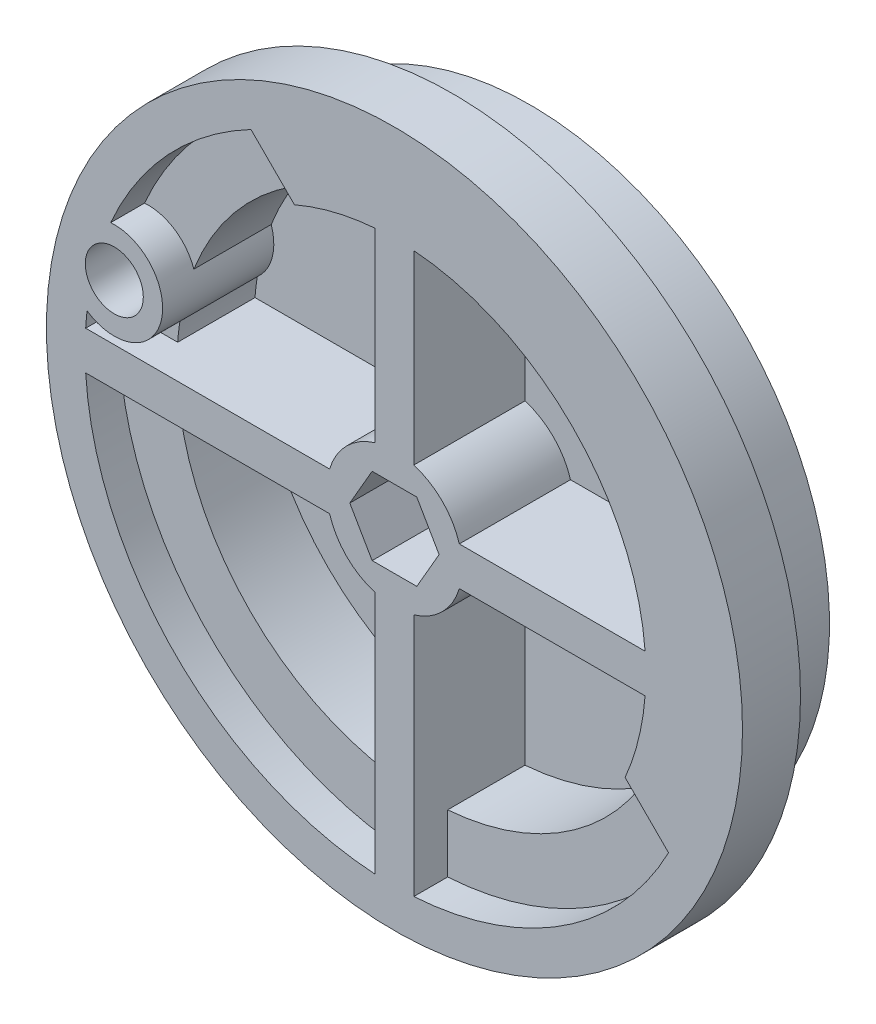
from build123d import *

# Parameters (mm, degrees)
ESQUISSE1_R             = 15.5
BASE_EXTRUSION_DEPTH    = 4
ESQUISSE2_R             = 18
BOSS_EXTRU_1_DEPTH      = 3
ENL_V_MAT_EXTRU_1_DEPTH = 1.75
ENL_V_MAT_EXTRU_2_DEPTH = 4
BOSS_EXTRU_6_DEPTH      = 1.75
BOSS_EXTRU_6_DEPTH_BACK = 8
ESQUISSE6_R             = 2.5
ESQUISSE7_R             = 1.5
ENL_V_MAT_EXTRU_3_DEPTH = 28.259172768
ENL_V_MAT_EXTRU_5_DEPTH = 28.259172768


with BuildPart() as part:
    # Esquisse1 → Base-Extrusion (new body)
    with BuildSketch(Plane.XY):
        Circle(ESQUISSE1_R)
    extrude(amount=BASE_EXTRUSION_DEPTH)

    # Esquisse2 → Boss.-Extru.1 (add)
    with BuildSketch(Plane.XY.offset(4)):
        Circle(ESQUISSE2_R)
    extrude(amount=BOSS_EXTRU_1_DEPTH)

    # Esquisse3 → Enl_v. mat.-Extru.1 (cut)
    with BuildSketch(Plane.XY.offset(7)):
        with BuildLine():
            Line((-1, 12.961481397), (-1, 3.354101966))
            ThreePointArc((-1, 3.354101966), (-2.474873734, 2.474873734), (-3.354101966, 1))
            Line((-3.354101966, 1), (-15.968719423, 1))
            ThreePointArc((-15.968719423, 1), (-13.422381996, 8.708596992), (-7.420499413, 14.17519624))
            Line((-7.420499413, 14.17519624), (-5.172126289, 11.926823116))
            ThreePointArc((-5.172126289, 11.926823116), (-3.129123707, 12.617788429), (-1, 12.961481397))
        make_face()
        with BuildLine():
            Line((12.961481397, 1), (3.354101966, 1))
            ThreePointArc((3.354101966, 1), (2.474873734, 2.474873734), (1, 3.354101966))
            Line((1, 3.354101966), (1, 12.961481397))
            ThreePointArc((1, 12.961481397), (9.192388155, 9.192388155), (12.961481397, 1))
        make_face()
        with BuildLine():
            Line((-15.968719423, -1), (-3.354101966, -1))
            ThreePointArc((-3.354101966, -1), (-2.474873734, -2.474873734), (-1, -3.354101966))
            Line((-1, -3.354101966), (-1, -15.968719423))
            ThreePointArc((-1, -15.968719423), (-11.313708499, -11.313708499), (-15.968719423, -1))
        make_face()
        with BuildLine():
            Line((1, -15.968719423), (1, -3.354101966))
            ThreePointArc((1, -3.354101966), (2.474873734, -2.474873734), (3.354101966, -1))
            Line((3.354101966, -1), (12.961481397, -1))
            ThreePointArc((12.961481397, -1), (12.617788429, -3.129123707), (11.926823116, -5.172126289))
            Line((11.926823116, -5.172126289), (14.17519624, -7.420499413))
            ThreePointArc((14.17519624, -7.420499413), (8.708596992, -13.422381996), (1, -15.968719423))
        make_face()
    extrude(amount=-ENL_V_MAT_EXTRU_1_DEPTH, mode=Mode.SUBTRACT)

    # Esquisse4 → Enl_v. mat.-Extru.2 (cut)
    with BuildSketch(Plane.XY.offset(5.25)):
        with BuildLine():
            Line((-12.961481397, 1), (-3.354101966, 1))
            ThreePointArc((-3.354101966, 1), (-2.474873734, 2.474873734), (-1, 3.354101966))
            Line((-1, 3.354101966), (-1, 12.961481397))
            ThreePointArc((-1, 12.961481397), (-9.192388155, 9.192388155), (-12.961481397, 1))
        make_face()
        with BuildLine():
            Line((1, 3.354101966), (1, 12.961481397))
            ThreePointArc((1, 12.961481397), (9.192388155, 9.192388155), (12.961481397, 1))
            Line((12.961481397, 1), (3.354101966, 1))
            ThreePointArc((3.354101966, 1), (2.474873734, 2.474873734), (1, 3.354101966))
        make_face()
        with BuildLine():
            Line((12.961481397, -1), (3.354101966, -1))
            ThreePointArc((3.354101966, -1), (2.474873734, -2.474873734), (1, -3.354101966))
            Line((1, -3.354101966), (1, -12.961481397))
            ThreePointArc((1, -12.961481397), (9.192388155, -9.192388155), (12.961481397, -1))
        make_face()
        with BuildLine():
            Line((-1, -3.354101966), (-1, -12.961481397))
            ThreePointArc((-1, -12.961481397), (-9.192388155, -9.192388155), (-12.961481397, -1))
            Line((-12.961481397, -1), (-3.354101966, -1))
            ThreePointArc((-3.354101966, -1), (-2.474873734, -2.474873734), (-1, -3.354101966))
        make_face()
    extrude(amount=-ENL_V_MAT_EXTRU_2_DEPTH, mode=Mode.SUBTRACT)

    # Esquisse6 → Boss.-Extru.6 (add, two sides: drawn at the far end of the back side and taken through both)
    with BuildSketch(Plane.XY.offset(5.25).offset(-BOSS_EXTRU_6_DEPTH_BACK)):
        with Locations(Location((-14.488887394, 3.882285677, 0), (0, 0, 248.107897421))):
            Circle(ESQUISSE6_R)
    extrude(amount=BOSS_EXTRU_6_DEPTH + BOSS_EXTRU_6_DEPTH_BACK)

    # Esquisse7 → Enl_v. mat.-Extru.3 (cut, through all)
    with BuildSketch(Plane.XY.offset(7)):
        with Locations((-14.488887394, 3.882285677)):
            Circle(ESQUISSE7_R)
    extrude(amount=-ENL_V_MAT_EXTRU_3_DEPTH, mode=Mode.SUBTRACT)

    # Esquisse9 → Enl_v. mat.-Extru.5 (cut, through all)
    with BuildSketch(Plane.XY.offset(7)):
        Polygon((-1.154700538, 2), (1.154700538, 2), (2.309401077, 0), (1.154700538, -2), (-1.154700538, -2), (-2.309401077, 0), align=None)
    extrude(amount=-ENL_V_MAT_EXTRU_5_DEPTH, mode=Mode.SUBTRACT)


solid = part.part
